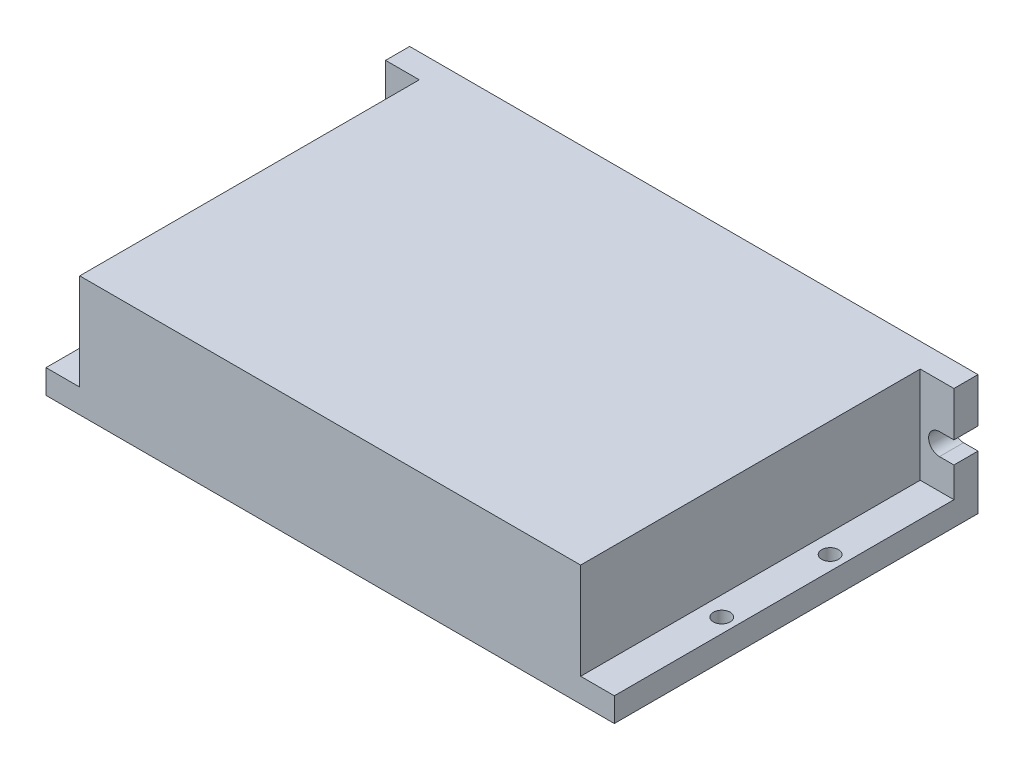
from build123d import *

# Parameters (mm, degrees)
SKETCH_1_W          = 118
SKETCH_1_H          = 75.5
EXTRUDE_1_DEPTH     = 25
SKETCH_3_W          = 7
SKETCH_3_H          = 20
CUT_EXTRUDE_1_DEPTH = 70.5
SKETCH_4_R          = 1.75
CUT_EXTRUDE_3_DEPTH = 5
CUT_EXTRUDE_4_DEPTH = 5


with BuildPart() as part:
    # Sketch 1 → Extrude 1 (new body)
    with BuildSketch(Plane(origin=(0, 0, 0), x_dir=(1, 0, 0), z_dir=(0, 1, 0))):
        Rectangle(SKETCH_1_W, SKETCH_1_H)
    extrude(amount=EXTRUDE_1_DEPTH)

    # Sketch 3 → Cut-Extrude 1 (cut)
    with BuildSketch(Plane.XY.offset(37.75)):
        with Locations((-55.5, 15)):
            Rectangle(SKETCH_3_W, SKETCH_3_H)
        with Locations((55.5, 15)):
            Rectangle(SKETCH_3_W, SKETCH_3_H)
    extrude(amount=-CUT_EXTRUDE_1_DEPTH, mode=Mode.SUBTRACT)

    # Sketch 4 → Cut-Extrude 3 (cut)
    with BuildSketch(Plane(origin=(0, 0, 0), x_dir=(1, 0, 0), z_dir=(0, 1, 0))):
        with Locations(Location((-56, 10.05, 0), (0, 0, 270))):
            Circle(SKETCH_4_R)
        with Locations(Location((-56, -12.45, 0), (0, 0, 270))):
            Circle(SKETCH_4_R)
        with Locations(Location((56, 10.05, 0), (0, 0, 270))):
            Circle(SKETCH_4_R)
        with Locations(Location((56, -12.45, 0), (0, 0, 270))):
            Circle(SKETCH_4_R)
    extrude(amount=CUT_EXTRUDE_3_DEPTH, mode=Mode.SUBTRACT)

    # Sketch 5 → Cut-Extrude 4 (cut)
    with BuildSketch(Plane.XY.offset(-32.75)):
        with BuildLine():
            Line((56, 15.75), (59, 15.75))
            Line((59, 15.75), (59, 11.25))
            Line((59, 11.25), (56, 11.25))
            ThreePointArc((56, 11.25), (53.75, 13.5), (56, 15.75))
        make_face()
        with BuildLine():
            Line((-56, 15.75), (-59, 15.75))
            Line((-59, 15.75), (-59, 11.25))
            Line((-59, 11.25), (-56, 11.25))
            ThreePointArc((-56, 11.25), (-53.75, 13.5), (-56, 15.75))
        make_face()
    extrude(amount=-CUT_EXTRUDE_4_DEPTH, mode=Mode.SUBTRACT)


solid = part.part
